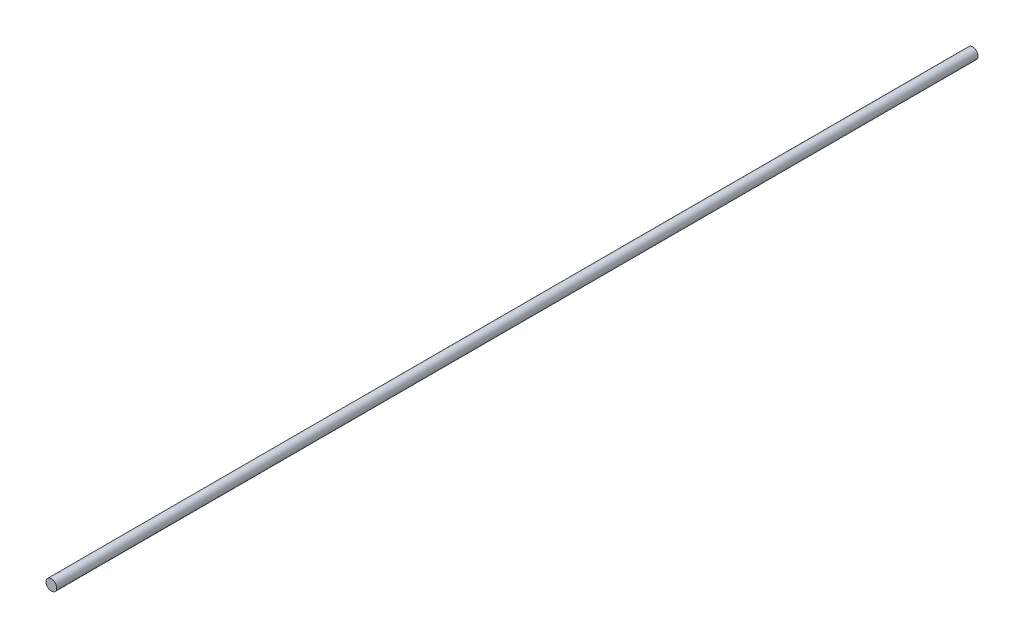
from build123d import *

# Parameters (mm, degrees)
SKETCH1_R           = 30
BOSS_EXTRUDE1_DEPTH = 5150


with BuildPart() as part:
    # Sketch1 → Boss-Extrude1 (new body)
    with BuildSketch(Plane.XY):
        Circle(SKETCH1_R)
    extrude(amount=-BOSS_EXTRUDE1_DEPTH)


solid = part.part
